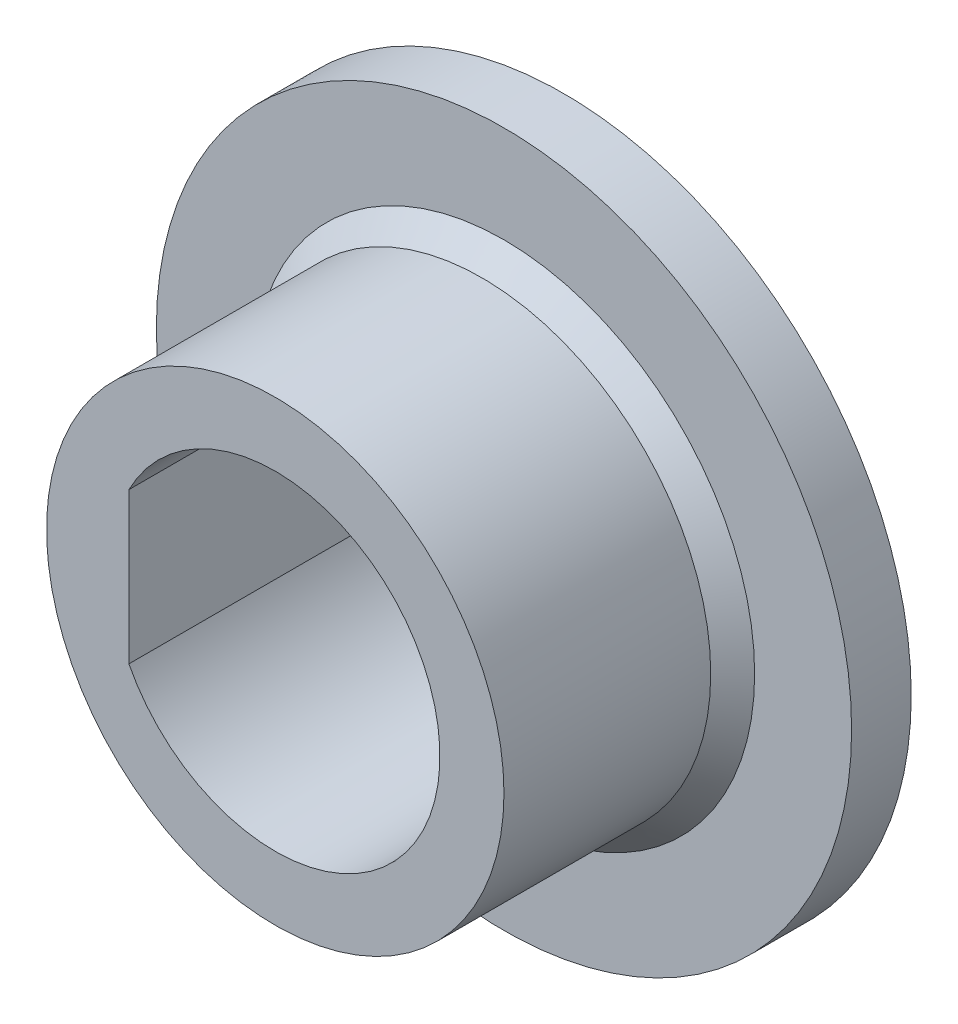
ISO-10303-21;
HEADER;
FILE_DESCRIPTION(('STEP AP214'),'2;1');
FILE_NAME('part.step','',(''),(''),'','','');
FILE_SCHEMA(('AUTOMOTIVE_DESIGN { 1 0 10303 214 1 1 1 1 }'));
ENDSEC;
DATA;
#1=APPLICATION_CONTEXT('core data for automotive mechanical design processes');
#2=APPLICATION_PROTOCOL_DEFINITION('international standard','automotive_design',2000,#1);
#3=PRODUCT_CONTEXT('',#1,'mechanical');
#4=PRODUCT('Part','Part','',(#3));
#5=PRODUCT_RELATED_PRODUCT_CATEGORY('part','',(#4));
#6=PRODUCT_DEFINITION_FORMATION('','',#4);
#7=PRODUCT_DEFINITION_CONTEXT('part definition',#1,'design');
#8=PRODUCT_DEFINITION('design','',#6,#7);
#9=PRODUCT_DEFINITION_SHAPE('','',#8);
#10=(LENGTH_UNIT() NAMED_UNIT(*) SI_UNIT(.MILLI.,.METRE.));
#11=(NAMED_UNIT(*) PLANE_ANGLE_UNIT() SI_UNIT($,.RADIAN.));
#12=(NAMED_UNIT(*) SI_UNIT($,.STERADIAN.) SOLID_ANGLE_UNIT());
#13=UNCERTAINTY_MEASURE_WITH_UNIT(LENGTH_MEASURE(1.E-05),#10,'distance_accuracy_value','');
#14=(GEOMETRIC_REPRESENTATION_CONTEXT(3) GLOBAL_UNCERTAINTY_ASSIGNED_CONTEXT((#13)) GLOBAL_UNIT_ASSIGNED_CONTEXT((#10,
#11,#12)) REPRESENTATION_CONTEXT('',''));
#15=CARTESIAN_POINT('',(0.,0.,0.));
#16=DIRECTION('',(0.,0.,1.));
#17=DIRECTION('',(1.,0.,0.));
#18=AXIS2_PLACEMENT_3D('',#15,#16,#17);
#19=CARTESIAN_POINT('',(0.,-83.7414213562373,0.));
#20=DIRECTION('',(0.,0.,1.));
#21=DIRECTION('',(1.,0.,0.));
#22=AXIS2_PLACEMENT_3D('',#19,#20,#21);
#23=PLANE('',#22);
#24=CARTESIAN_POINT('',(0.,0.,0.));
#25=DIRECTION('',(0.,0.,1.));
#26=DIRECTION('',(1.,0.,0.));
#27=AXIS2_PLACEMENT_3D('',#24,#25,#26);
#28=CIRCLE('',#27,22.3669500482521);
#29=CARTESIAN_POINT('',(22.3669500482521,0.,0.));
#30=VERTEX_POINT('',#29);
#31=EDGE_CURVE('E26',#30,#30,#28,.F.);
#32=ORIENTED_EDGE('',*,*,#31,.T.);
#33=EDGE_LOOP('',(#32));
#34=FACE_BOUND('',#33,.T.);
#35=CARTESIAN_POINT('',(0.,0.,0.));
#36=DIRECTION('',(0.,0.,1.));
#37=DIRECTION('',(1.,0.,0.));
#38=AXIS2_PLACEMENT_3D('',#35,#36,#37);
#39=CIRCLE('',#38,18.);
#40=CARTESIAN_POINT('',(-16.0000000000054,-8.24621125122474,0.));
#41=VERTEX_POINT('',#40);
#42=CARTESIAN_POINT('',(-16.0000000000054,8.24621125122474,0.));
#43=VERTEX_POINT('',#42);
#44=EDGE_CURVE('E45',#41,#43,#39,.T.);
#45=ORIENTED_EDGE('',*,*,#44,.T.);
#46=DIRECTION('',(0.,-1.,0.));
#47=VECTOR('',#46,1.);
#48=CARTESIAN_POINT('',(-16.0000000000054,-83.7414213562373,0.));
#49=LINE('',#48,#47);
#50=EDGE_CURVE('E53',#43,#41,#49,.T.);
#51=ORIENTED_EDGE('',*,*,#50,.T.);
#52=EDGE_LOOP('',(#45,#51));
#53=FACE_BOUND('',#52,.T.);
#54=ADVANCED_FACE('F17',(#34,#53),#23,.F.);
#55=CARTESIAN_POINT('',(0.,0.,10.));
#56=DIRECTION('',(0.,0.,-1.));
#57=DIRECTION('',(-1.,0.,0.));
#58=AXIS2_PLACEMENT_3D('',#55,#56,#57);
#59=CYLINDRICAL_SURFACE('',#58,38.);
#60=CARTESIAN_POINT('',(0.,0.,10.));
#61=DIRECTION('',(0.,0.,1.));
#62=DIRECTION('',(1.,0.,0.));
#63=AXIS2_PLACEMENT_3D('',#60,#61,#62);
#64=CIRCLE('',#63,38.);
#65=CARTESIAN_POINT('',(38.,0.,10.));
#66=VERTEX_POINT('',#65);
#67=EDGE_CURVE('E54',#66,#66,#64,.T.);
#68=ORIENTED_EDGE('',*,*,#67,.F.);
#69=EDGE_LOOP('',(#68));
#70=FACE_BOUND('',#69,.T.);
#71=CARTESIAN_POINT('',(0.,0.,3.4833395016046));
#72=DIRECTION('',(0.,0.,1.));
#73=DIRECTION('',(1.,0.,0.));
#74=AXIS2_PLACEMENT_3D('',#71,#72,#73);
#75=CIRCLE('',#74,38.);
#76=CARTESIAN_POINT('',(38.,0.,3.4833395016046));
#77=VERTEX_POINT('',#76);
#78=EDGE_CURVE('E69',#77,#77,#75,.F.);
#79=ORIENTED_EDGE('',*,*,#78,.F.);
#80=EDGE_LOOP('',(#79));
#81=FACE_BOUND('',#80,.T.);
#82=ADVANCED_FACE('F88',(#70,#81),#59,.T.);
#83=CARTESIAN_POINT('',(0.,0.,35.));
#84=DIRECTION('',(0.,0.,-1.));
#85=DIRECTION('',(-1.,0.,0.));
#86=AXIS2_PLACEMENT_3D('',#83,#84,#85);
#87=CYLINDRICAL_SURFACE('',#86,18.);
#88=ORIENTED_EDGE('',*,*,#44,.F.);
#89=DIRECTION('',(0.,0.,-1.));
#90=VECTOR('',#89,1.);
#91=CARTESIAN_POINT('',(-16.0000000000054,-8.24621125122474,35.));
#92=LINE('',#91,#90);
#93=CARTESIAN_POINT('',(-16.0000000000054,-8.24621125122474,35.));
#94=VERTEX_POINT('',#93);
#95=EDGE_CURVE('E40',#94,#41,#92,.T.);
#96=ORIENTED_EDGE('',*,*,#95,.F.);
#97=CARTESIAN_POINT('',(0.,0.,35.));
#98=DIRECTION('',(0.,0.,1.));
#99=DIRECTION('',(1.,0.,0.));
#100=AXIS2_PLACEMENT_3D('',#97,#98,#99);
#101=CIRCLE('',#100,18.);
#102=CARTESIAN_POINT('',(-16.0000000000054,8.24621125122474,35.));
#103=VERTEX_POINT('',#102);
#104=EDGE_CURVE('E48',#94,#103,#101,.T.);
#105=ORIENTED_EDGE('',*,*,#104,.T.);
#106=DIRECTION('',(0.,0.,-1.));
#107=VECTOR('',#106,1.);
#108=CARTESIAN_POINT('',(-16.0000000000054,8.24621125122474,35.));
#109=LINE('',#108,#107);
#110=EDGE_CURVE('E34',#103,#43,#109,.T.);
#111=ORIENTED_EDGE('',*,*,#110,.T.);
#112=EDGE_LOOP('',(#88,#96,#105,#111));
#113=FACE_BOUND('',#112,.T.);
#114=ADVANCED_FACE('F44',(#113),#87,.F.);
#115=CARTESIAN_POINT('',(-16.0000000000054,-83.7414213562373,35.));
#116=DIRECTION('',(1.,0.,0.));
#117=DIRECTION('',(0.,0.,-1.));
#118=AXIS2_PLACEMENT_3D('',#115,#116,#117);
#119=PLANE('',#118);
#120=ORIENTED_EDGE('',*,*,#50,.F.);
#121=ORIENTED_EDGE('',*,*,#110,.F.);
#122=DIRECTION('',(0.,-1.,0.));
#123=VECTOR('',#122,1.);
#124=CARTESIAN_POINT('',(-16.0000000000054,-83.7414213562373,35.));
#125=LINE('',#124,#123);
#126=EDGE_CURVE('E58',#103,#94,#125,.T.);
#127=ORIENTED_EDGE('',*,*,#126,.T.);
#128=ORIENTED_EDGE('',*,*,#95,.T.);
#129=EDGE_LOOP('',(#120,#121,#127,#128));
#130=FACE_BOUND('',#129,.T.);
#131=ADVANCED_FACE('F56',(#130),#119,.T.);
#132=CARTESIAN_POINT('',(0.,0.,35.));
#133=DIRECTION('',(0.,0.,-1.));
#134=DIRECTION('',(-1.,0.,0.));
#135=AXIS2_PLACEMENT_3D('',#132,#133,#134);
#136=CYLINDRICAL_SURFACE('',#135,25.);
#137=CARTESIAN_POINT('',(0.,0.,12.4));
#138=DIRECTION('',(0.,0.,1.));
#139=DIRECTION('',(1.,0.,0.));
#140=AXIS2_PLACEMENT_3D('',#137,#138,#139);
#141=CIRCLE('',#140,25.);
#142=CARTESIAN_POINT('',(25.,0.,12.4));
#143=VERTEX_POINT('',#142);
#144=EDGE_CURVE('E63',#143,#143,#141,.T.);
#145=ORIENTED_EDGE('',*,*,#144,.T.);
#146=EDGE_LOOP('',(#145));
#147=FACE_BOUND('',#146,.T.);
#148=CARTESIAN_POINT('',(0.,0.,35.));
#149=DIRECTION('',(0.,0.,1.));
#150=DIRECTION('',(1.,0.,0.));
#151=AXIS2_PLACEMENT_3D('',#148,#149,#150);
#152=CIRCLE('',#151,25.);
#153=CARTESIAN_POINT('',(25.,0.,35.));
#154=VERTEX_POINT('',#153);
#155=EDGE_CURVE('E50',#154,#154,#152,.T.);
#156=ORIENTED_EDGE('',*,*,#155,.F.);
#157=EDGE_LOOP('',(#156));
#158=FACE_BOUND('',#157,.T.);
#159=ADVANCED_FACE('F99',(#147,#158),#136,.T.);
#160=CARTESIAN_POINT('',(0.,-83.7414213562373,35.));
#161=DIRECTION('',(0.,0.,1.));
#162=DIRECTION('',(1.,0.,0.));
#163=AXIS2_PLACEMENT_3D('',#160,#161,#162);
#164=PLANE('',#163);
#165=ORIENTED_EDGE('',*,*,#104,.F.);
#166=ORIENTED_EDGE('',*,*,#126,.F.);
#167=EDGE_LOOP('',(#165,#166));
#168=FACE_BOUND('',#167,.T.);
#169=ORIENTED_EDGE('',*,*,#155,.T.);
#170=EDGE_LOOP('',(#169));
#171=FACE_BOUND('',#170,.T.);
#172=ADVANCED_FACE('F98',(#168,#171),#164,.T.);
#173=CARTESIAN_POINT('',(0.,-83.7414213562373,10.));
#174=DIRECTION('',(0.,0.,1.));
#175=DIRECTION('',(1.,0.,0.));
#176=AXIS2_PLACEMENT_3D('',#173,#174,#175);
#177=PLANE('',#176);
#178=CARTESIAN_POINT('',(0.,0.,10.));
#179=DIRECTION('',(0.,0.,1.));
#180=DIRECTION('',(1.,0.,0.));
#181=AXIS2_PLACEMENT_3D('',#178,#179,#180);
#182=CIRCLE('',#181,27.4);
#183=CARTESIAN_POINT('',(27.4,0.,10.));
#184=VERTEX_POINT('',#183);
#185=EDGE_CURVE('E66',#184,#184,#182,.F.);
#186=ORIENTED_EDGE('',*,*,#185,.T.);
#187=EDGE_LOOP('',(#186));
#188=FACE_BOUND('',#187,.T.);
#189=ORIENTED_EDGE('',*,*,#67,.T.);
#190=EDGE_LOOP('',(#189));
#191=FACE_BOUND('',#190,.T.);
#192=ADVANCED_FACE('F107',(#188,#191),#177,.T.);
#193=CARTESIAN_POINT('',(0.,0.,12.4));
#194=DIRECTION('',(0.,0.,-1.));
#195=DIRECTION('',(-1.,0.,0.));
#196=AXIS2_PLACEMENT_3D('',#193,#194,#195);
#197=CONICAL_SURFACE('',#196,25.,0.785398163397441);
#198=ORIENTED_EDGE('',*,*,#185,.F.);
#199=EDGE_LOOP('',(#198));
#200=FACE_BOUND('',#199,.T.);
#201=ORIENTED_EDGE('',*,*,#144,.F.);
#202=EDGE_LOOP('',(#201));
#203=FACE_BOUND('',#202,.T.);
#204=ADVANCED_FACE('F83',(#200,#203),#197,.T.);
#205=CARTESIAN_POINT('',(0.,0.,0.));
#206=DIRECTION('',(0.,0.,1.));
#207=DIRECTION('',(-1.,0.,0.));
#208=AXIS2_PLACEMENT_3D('',#205,#206,#207);
#209=CONICAL_SURFACE('',#208,25.,1.30899693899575);
#210=CARTESIAN_POINT('',(0.,0.,0.681483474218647));
#211=DIRECTION('',(0.,0.,1.));
#212=DIRECTION('',(1.,0.,0.));
#213=AXIS2_PLACEMENT_3D('',#210,#211,#212);
#214=CIRCLE('',#213,27.5433309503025);
#215=CARTESIAN_POINT('',(27.5433309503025,0.,0.681483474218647));
#216=VERTEX_POINT('',#215);
#217=EDGE_CURVE('E11',#216,#216,#214,.T.);
#218=ORIENTED_EDGE('',*,*,#217,.T.);
#219=EDGE_LOOP('',(#218));
#220=FACE_BOUND('',#219,.T.);
#221=ORIENTED_EDGE('',*,*,#78,.T.);
#222=EDGE_LOOP('',(#221));
#223=FACE_BOUND('',#222,.T.);
#224=ADVANCED_FACE('F76',(#220,#223),#209,.T.);
#225=CARTESIAN_POINT('',(0.,0.,20.));
#226=DIRECTION('',(0.,0.,1.));
#227=DIRECTION('',(1.,0.,0.));
#228=AXIS2_PLACEMENT_3D('',#225,#226,#227);
#229=TOROIDAL_SURFACE('',#228,22.3669500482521,20.);
#230=ORIENTED_EDGE('',*,*,#217,.F.);
#231=EDGE_LOOP('',(#230));
#232=FACE_BOUND('',#231,.T.);
#233=ORIENTED_EDGE('',*,*,#31,.F.);
#234=EDGE_LOOP('',(#233));
#235=FACE_BOUND('',#234,.T.);
#236=ADVANCED_FACE('F19',(#232,#235),#229,.T.);
#237=CLOSED_SHELL('',(#54,#82,#114,#131,#159,#172,#192,#204,#224,#236));
#238=MANIFOLD_SOLID_BREP('B1',#237);
#239=ADVANCED_BREP_SHAPE_REPRESENTATION('',(#18,#238),#14);
#240=SHAPE_DEFINITION_REPRESENTATION(#9,#239);
ENDSEC;
END-ISO-10303-21;
